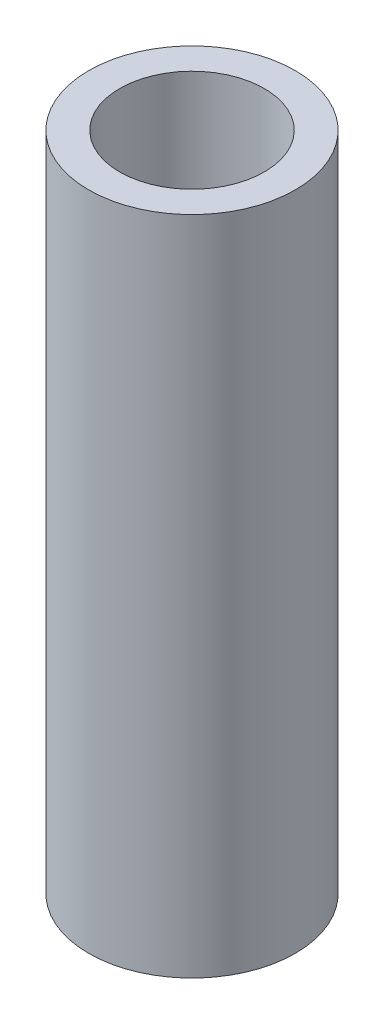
from build123d import *

# Parameters (mm, degrees)
SKETCH1_R      = 7.9375
SKETCH1_R_2    = 5.55625
EXTRUDE1_DEPTH = 50.8


with BuildPart() as part:
    # Sketch1 → Extrude1 (new body)
    with BuildSketch(Plane(origin=(0, 0, 0), x_dir=(1, 0, 0), z_dir=(0, 1, 0))):
        with Locations(Location((0, 0, 0), (0, 0, 270))):
            Circle(SKETCH1_R)
        with Locations(Location((0, 0, 0), (0, 0, 270))):
            Circle(SKETCH1_R_2, mode=Mode.SUBTRACT)
    extrude(amount=EXTRUDE1_DEPTH)


solid = part.part
